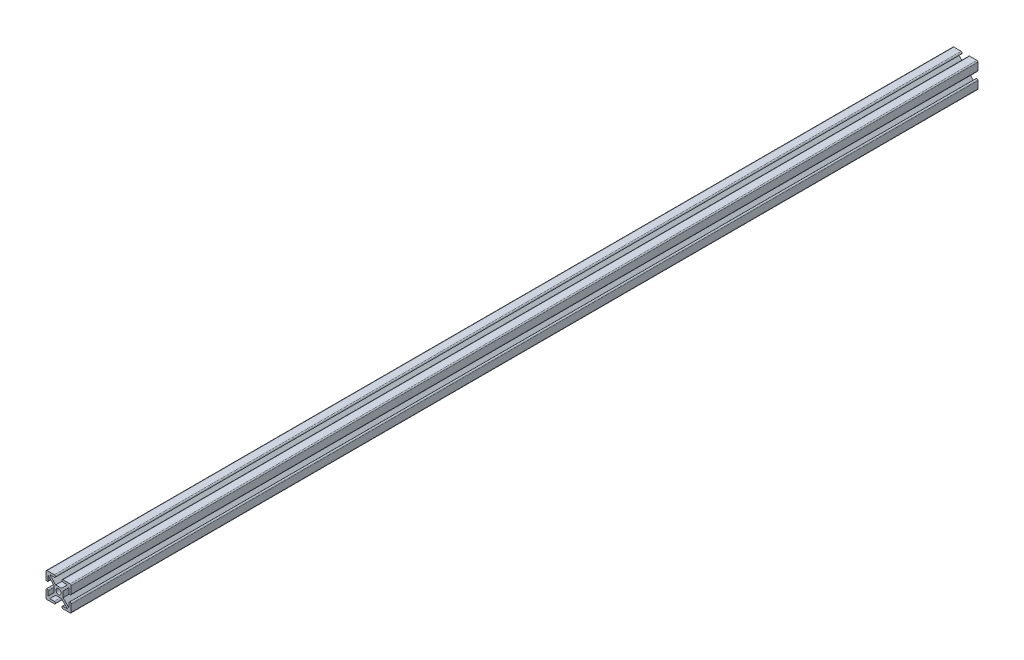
ISO-10303-21;
HEADER;
FILE_DESCRIPTION(('STEP AP214'),'2;1');
FILE_NAME('part.step','',(''),(''),'','','');
FILE_SCHEMA(('AUTOMOTIVE_DESIGN { 1 0 10303 214 1 1 1 1 }'));
ENDSEC;
DATA;
#1=APPLICATION_CONTEXT('core data for automotive mechanical design processes');
#2=APPLICATION_PROTOCOL_DEFINITION('international standard','automotive_design',2000,#1);
#3=PRODUCT_CONTEXT('',#1,'mechanical');
#4=PRODUCT('Part','Part','',(#3));
#5=PRODUCT_RELATED_PRODUCT_CATEGORY('part','',(#4));
#6=PRODUCT_DEFINITION_FORMATION('','',#4);
#7=PRODUCT_DEFINITION_CONTEXT('part definition',#1,'design');
#8=PRODUCT_DEFINITION('design','',#6,#7);
#9=PRODUCT_DEFINITION_SHAPE('','',#8);
#10=(LENGTH_UNIT() NAMED_UNIT(*) SI_UNIT(.MILLI.,.METRE.));
#11=(NAMED_UNIT(*) PLANE_ANGLE_UNIT() SI_UNIT($,.RADIAN.));
#12=(NAMED_UNIT(*) SI_UNIT($,.STERADIAN.) SOLID_ANGLE_UNIT());
#13=UNCERTAINTY_MEASURE_WITH_UNIT(LENGTH_MEASURE(1.E-05),#10,'distance_accuracy_value','');
#14=(GEOMETRIC_REPRESENTATION_CONTEXT(3) GLOBAL_UNCERTAINTY_ASSIGNED_CONTEXT((#13)) GLOBAL_UNIT_ASSIGNED_CONTEXT((#10,
#11,#12)) REPRESENTATION_CONTEXT('',''));
#15=CARTESIAN_POINT('',(0.,0.,0.));
#16=DIRECTION('',(0.,0.,1.));
#17=DIRECTION('',(1.,0.,0.));
#18=AXIS2_PLACEMENT_3D('',#15,#16,#17);
#19=CARTESIAN_POINT('',(-4.5085,0.,-457.2));
#20=DIRECTION('',(1.,0.,0.));
#21=DIRECTION('',(0.,0.,-1.));
#22=AXIS2_PLACEMENT_3D('',#19,#20,#21);
#23=PLANE('',#22);
#24=DIRECTION('',(0.,1.,0.));
#25=VECTOR('',#24,1.);
#26=CARTESIAN_POINT('',(-4.5085,0.,457.2));
#27=LINE('',#26,#25);
#28=CARTESIAN_POINT('',(-4.5085,-2.94593543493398,457.2));
#29=VERTEX_POINT('',#28);
#30=CARTESIAN_POINT('',(-4.5085,2.94593543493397,457.2));
#31=VERTEX_POINT('',#30);
#32=EDGE_CURVE('E327',#29,#31,#27,.T.);
#33=ORIENTED_EDGE('',*,*,#32,.T.);
#34=DIRECTION('',(0.,0.,1.));
#35=VECTOR('',#34,1.);
#36=CARTESIAN_POINT('',(-4.5085,2.94593543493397,-457.2));
#37=LINE('',#36,#35);
#38=CARTESIAN_POINT('',(-4.5085,2.94593543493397,-457.2));
#39=VERTEX_POINT('',#38);
#40=EDGE_CURVE('E11',#39,#31,#37,.T.);
#41=ORIENTED_EDGE('',*,*,#40,.F.);
#42=DIRECTION('',(0.,1.,0.));
#43=VECTOR('',#42,1.);
#44=CARTESIAN_POINT('',(-4.5085,0.,-457.2));
#45=LINE('',#44,#43);
#46=CARTESIAN_POINT('',(-4.5085,-2.94593543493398,-457.2));
#47=VERTEX_POINT('',#46);
#48=EDGE_CURVE('E52',#47,#39,#45,.T.);
#49=ORIENTED_EDGE('',*,*,#48,.F.);
#50=DIRECTION('',(0.,0.,1.));
#51=VECTOR('',#50,1.);
#52=CARTESIAN_POINT('',(-4.5085,-2.94593543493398,-457.2));
#53=LINE('',#52,#51);
#54=EDGE_CURVE('E37',#47,#29,#53,.T.);
#55=ORIENTED_EDGE('',*,*,#54,.T.);
#56=EDGE_LOOP('',(#33,#41,#49,#55));
#57=FACE_BOUND('',#56,.T.);
#58=ADVANCED_FACE('F34',(#57),#23,.F.);
#59=CARTESIAN_POINT('',(-0.781282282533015,-0.781282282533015,-457.2));
#60=DIRECTION('',(-0.707106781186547,-0.707106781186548,0.));
#61=DIRECTION('',(0.707106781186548,-0.707106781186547,0.));
#62=AXIS2_PLACEMENT_3D('',#59,#60,#61);
#63=PLANE('',#62);
#64=DIRECTION('',(0.707106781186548,-0.707106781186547,0.));
#65=VECTOR('',#64,1.);
#66=CARTESIAN_POINT('',(-0.781282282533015,-0.781282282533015,457.2));
#67=LINE('',#66,#65);
#68=CARTESIAN_POINT('',(-10.4902,8.92763543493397,457.2));
#69=VERTEX_POINT('',#68);
#70=EDGE_CURVE('E440',#69,#31,#67,.T.);
#71=ORIENTED_EDGE('',*,*,#70,.F.);
#72=DIRECTION('',(0.,0.,1.));
#73=VECTOR('',#72,1.);
#74=CARTESIAN_POINT('',(-10.4902,8.92763543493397,-457.2));
#75=LINE('',#74,#73);
#76=CARTESIAN_POINT('',(-10.4902,8.92763543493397,-457.2));
#77=VERTEX_POINT('',#76);
#78=EDGE_CURVE('E43',#77,#69,#75,.T.);
#79=ORIENTED_EDGE('',*,*,#78,.F.);
#80=DIRECTION('',(0.707106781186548,-0.707106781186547,0.));
#81=VECTOR('',#80,1.);
#82=CARTESIAN_POINT('',(-0.781282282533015,-0.781282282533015,-457.2));
#83=LINE('',#82,#81);
#84=EDGE_CURVE('E314',#77,#39,#83,.T.);
#85=ORIENTED_EDGE('',*,*,#84,.T.);
#86=ORIENTED_EDGE('',*,*,#40,.T.);
#87=EDGE_LOOP('',(#71,#79,#85,#86));
#88=FACE_BOUND('',#87,.T.);
#89=ADVANCED_FACE('F536',(#88),#63,.T.);
#90=CARTESIAN_POINT('',(-10.4902,0.,-457.2));
#91=DIRECTION('',(1.,0.,0.));
#92=DIRECTION('',(0.,1.,0.));
#93=AXIS2_PLACEMENT_3D('',#90,#91,#92);
#94=PLANE('',#93);
#95=DIRECTION('',(0.,1.,0.));
#96=VECTOR('',#95,1.);
#97=CARTESIAN_POINT('',(-10.4902,0.,457.2));
#98=LINE('',#97,#96);
#99=CARTESIAN_POINT('',(-10.4902,4.3434,457.2));
#100=VERTEX_POINT('',#99);
#101=EDGE_CURVE('E301',#100,#69,#98,.T.);
#102=ORIENTED_EDGE('',*,*,#101,.F.);
#103=DIRECTION('',(0.,0.,1.));
#104=VECTOR('',#103,1.);
#105=CARTESIAN_POINT('',(-10.4902,4.3434,-457.2));
#106=LINE('',#105,#104);
#107=CARTESIAN_POINT('',(-10.4902,4.3434,-457.2));
#108=VERTEX_POINT('',#107);
#109=EDGE_CURVE('E297',#108,#100,#106,.T.);
#110=ORIENTED_EDGE('',*,*,#109,.F.);
#111=DIRECTION('',(0.,1.,0.));
#112=VECTOR('',#111,1.);
#113=CARTESIAN_POINT('',(-10.4902,0.,-457.2));
#114=LINE('',#113,#112);
#115=EDGE_CURVE('E300',#108,#77,#114,.T.);
#116=ORIENTED_EDGE('',*,*,#115,.T.);
#117=ORIENTED_EDGE('',*,*,#78,.T.);
#118=EDGE_LOOP('',(#102,#110,#116,#117));
#119=FACE_BOUND('',#118,.T.);
#120=ADVANCED_FACE('F299',(#119),#94,.T.);
#121=CARTESIAN_POINT('',(-11.5951,4.34339999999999,-457.2));
#122=DIRECTION('',(0.,0.,1.));
#123=DIRECTION('',(1.,0.,0.));
#124=AXIS2_PLACEMENT_3D('',#121,#122,#123);
#125=CYLINDRICAL_SURFACE('',#124,1.1049);
#126=CARTESIAN_POINT('',(-11.5951,4.34339999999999,457.2));
#127=DIRECTION('',(0.,0.,1.));
#128=DIRECTION('',(1.,0.,0.));
#129=AXIS2_PLACEMENT_3D('',#126,#127,#128);
#130=CIRCLE('',#129,1.1049);
#131=CARTESIAN_POINT('',(-12.7,4.3434,457.2));
#132=VERTEX_POINT('',#131);
#133=EDGE_CURVE('E437',#132,#100,#130,.T.);
#134=ORIENTED_EDGE('',*,*,#133,.F.);
#135=DIRECTION('',(0.,0.,1.));
#136=VECTOR('',#135,1.);
#137=CARTESIAN_POINT('',(-12.7,4.3434,-457.2));
#138=LINE('',#137,#136);
#139=CARTESIAN_POINT('',(-12.7,4.3434,-457.2));
#140=VERTEX_POINT('',#139);
#141=EDGE_CURVE('E306',#140,#132,#138,.T.);
#142=ORIENTED_EDGE('',*,*,#141,.F.);
#143=CARTESIAN_POINT('',(-11.5951,4.34339999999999,-457.2));
#144=DIRECTION('',(0.,0.,1.));
#145=DIRECTION('',(1.,0.,0.));
#146=AXIS2_PLACEMENT_3D('',#143,#144,#145);
#147=CIRCLE('',#146,1.1049);
#148=EDGE_CURVE('E312',#140,#108,#147,.T.);
#149=ORIENTED_EDGE('',*,*,#148,.T.);
#150=ORIENTED_EDGE('',*,*,#109,.T.);
#151=EDGE_LOOP('',(#134,#142,#149,#150));
#152=FACE_BOUND('',#151,.T.);
#153=ADVANCED_FACE('F316',(#152),#125,.T.);
#154=CARTESIAN_POINT('',(-12.7,0.,-457.2));
#155=DIRECTION('',(-1.,0.,0.));
#156=DIRECTION('',(0.,-1.,0.));
#157=AXIS2_PLACEMENT_3D('',#154,#155,#156);
#158=PLANE('',#157);
#159=DIRECTION('',(0.,-1.,0.));
#160=VECTOR('',#159,1.);
#161=CARTESIAN_POINT('',(-12.7,0.,457.2));
#162=LINE('',#161,#160);
#163=CARTESIAN_POINT('',(-12.7,11.5951,457.2));
#164=VERTEX_POINT('',#163);
#165=EDGE_CURVE('E434',#164,#132,#162,.T.);
#166=ORIENTED_EDGE('',*,*,#165,.F.);
#167=DIRECTION('',(0.,0.,1.));
#168=VECTOR('',#167,1.);
#169=CARTESIAN_POINT('',(-12.7,11.5951,-457.2));
#170=LINE('',#169,#168);
#171=CARTESIAN_POINT('',(-12.7,11.5951,-457.2));
#172=VERTEX_POINT('',#171);
#173=EDGE_CURVE('E448',#172,#164,#170,.T.);
#174=ORIENTED_EDGE('',*,*,#173,.F.);
#175=DIRECTION('',(0.,-1.,0.));
#176=VECTOR('',#175,1.);
#177=CARTESIAN_POINT('',(-12.7,0.,-457.2));
#178=LINE('',#177,#176);
#179=EDGE_CURVE('E317',#172,#140,#178,.T.);
#180=ORIENTED_EDGE('',*,*,#179,.T.);
#181=ORIENTED_EDGE('',*,*,#141,.T.);
#182=EDGE_LOOP('',(#166,#174,#180,#181));
#183=FACE_BOUND('',#182,.T.);
#184=ADVANCED_FACE('F549',(#183),#158,.T.);
#185=CARTESIAN_POINT('',(-11.5951,11.5951,-457.2));
#186=DIRECTION('',(0.,0.,1.));
#187=DIRECTION('',(1.,0.,0.));
#188=AXIS2_PLACEMENT_3D('',#185,#186,#187);
#189=CYLINDRICAL_SURFACE('',#188,1.1049);
#190=CARTESIAN_POINT('',(-11.5951,11.5951,457.2));
#191=DIRECTION('',(0.,0.,1.));
#192=DIRECTION('',(1.,0.,0.));
#193=AXIS2_PLACEMENT_3D('',#190,#191,#192);
#194=CIRCLE('',#193,1.1049);
#195=CARTESIAN_POINT('',(-11.5951,12.7,457.2));
#196=VERTEX_POINT('',#195);
#197=EDGE_CURVE('E431',#196,#164,#194,.T.);
#198=ORIENTED_EDGE('',*,*,#197,.F.);
#199=DIRECTION('',(0.,0.,1.));
#200=VECTOR('',#199,1.);
#201=CARTESIAN_POINT('',(-11.5951,12.7,-457.2));
#202=LINE('',#201,#200);
#203=CARTESIAN_POINT('',(-11.5951,12.7,-457.2));
#204=VERTEX_POINT('',#203);
#205=EDGE_CURVE('E450',#204,#196,#202,.T.);
#206=ORIENTED_EDGE('',*,*,#205,.F.);
#207=CARTESIAN_POINT('',(-11.5951,11.5951,-457.2));
#208=DIRECTION('',(0.,0.,1.));
#209=DIRECTION('',(1.,0.,0.));
#210=AXIS2_PLACEMENT_3D('',#207,#208,#209);
#211=CIRCLE('',#210,1.1049);
#212=EDGE_CURVE('E319',#204,#172,#211,.T.);
#213=ORIENTED_EDGE('',*,*,#212,.T.);
#214=ORIENTED_EDGE('',*,*,#173,.T.);
#215=EDGE_LOOP('',(#198,#206,#213,#214));
#216=FACE_BOUND('',#215,.T.);
#217=ADVANCED_FACE('F552',(#216),#189,.T.);
#218=CARTESIAN_POINT('',(0.,12.7,-457.2));
#219=DIRECTION('',(0.,1.,0.));
#220=DIRECTION('',(-1.,0.,0.));
#221=AXIS2_PLACEMENT_3D('',#218,#219,#220);
#222=PLANE('',#221);
#223=DIRECTION('',(-1.,0.,0.));
#224=VECTOR('',#223,1.);
#225=CARTESIAN_POINT('',(0.,12.7,457.2));
#226=LINE('',#225,#224);
#227=CARTESIAN_POINT('',(-4.3434,12.7,457.2));
#228=VERTEX_POINT('',#227);
#229=EDGE_CURVE('E428',#228,#196,#226,.T.);
#230=ORIENTED_EDGE('',*,*,#229,.F.);
#231=DIRECTION('',(0.,0.,1.));
#232=VECTOR('',#231,1.);
#233=CARTESIAN_POINT('',(-4.3434,12.7,-457.2));
#234=LINE('',#233,#232);
#235=CARTESIAN_POINT('',(-4.3434,12.7,-457.2));
#236=VERTEX_POINT('',#235);
#237=EDGE_CURVE('E452',#236,#228,#234,.T.);
#238=ORIENTED_EDGE('',*,*,#237,.F.);
#239=DIRECTION('',(-1.,0.,0.));
#240=VECTOR('',#239,1.);
#241=CARTESIAN_POINT('',(0.,12.7,-457.2));
#242=LINE('',#241,#240);
#243=EDGE_CURVE('E785',#236,#204,#242,.T.);
#244=ORIENTED_EDGE('',*,*,#243,.T.);
#245=ORIENTED_EDGE('',*,*,#205,.T.);
#246=EDGE_LOOP('',(#230,#238,#244,#245));
#247=FACE_BOUND('',#246,.T.);
#248=ADVANCED_FACE('F556',(#247),#222,.T.);
#249=CARTESIAN_POINT('',(-4.3434,11.5951,-457.2));
#250=DIRECTION('',(0.,0.,1.));
#251=DIRECTION('',(1.,0.,0.));
#252=AXIS2_PLACEMENT_3D('',#249,#250,#251);
#253=CYLINDRICAL_SURFACE('',#252,1.1049);
#254=CARTESIAN_POINT('',(-4.3434,11.5951,457.2));
#255=DIRECTION('',(0.,0.,1.));
#256=DIRECTION('',(1.,0.,0.));
#257=AXIS2_PLACEMENT_3D('',#254,#255,#256);
#258=CIRCLE('',#257,1.1049);
#259=CARTESIAN_POINT('',(-4.3434,10.4902,457.2));
#260=VERTEX_POINT('',#259);
#261=EDGE_CURVE('E425',#228,#260,#258,.F.);
#262=ORIENTED_EDGE('',*,*,#261,.T.);
#263=DIRECTION('',(0.,0.,1.));
#264=VECTOR('',#263,1.);
#265=CARTESIAN_POINT('',(-4.3434,10.4902,-457.2));
#266=LINE('',#265,#264);
#267=CARTESIAN_POINT('',(-4.3434,10.4902,-457.2));
#268=VERTEX_POINT('',#267);
#269=EDGE_CURVE('E454',#268,#260,#266,.T.);
#270=ORIENTED_EDGE('',*,*,#269,.F.);
#271=CARTESIAN_POINT('',(-4.3434,11.5951,-457.2));
#272=DIRECTION('',(0.,0.,1.));
#273=DIRECTION('',(1.,0.,0.));
#274=AXIS2_PLACEMENT_3D('',#271,#272,#273);
#275=CIRCLE('',#274,1.1049);
#276=EDGE_CURVE('E783',#236,#268,#275,.F.);
#277=ORIENTED_EDGE('',*,*,#276,.F.);
#278=ORIENTED_EDGE('',*,*,#237,.T.);
#279=EDGE_LOOP('',(#262,#270,#277,#278));
#280=FACE_BOUND('',#279,.T.);
#281=ADVANCED_FACE('F560',(#280),#253,.T.);
#282=CARTESIAN_POINT('',(0.,10.4902,-457.2));
#283=DIRECTION('',(0.,-1.,0.));
#284=DIRECTION('',(1.,0.,0.));
#285=AXIS2_PLACEMENT_3D('',#282,#283,#284);
#286=PLANE('',#285);
#287=DIRECTION('',(1.,0.,0.));
#288=VECTOR('',#287,1.);
#289=CARTESIAN_POINT('',(0.,10.4902,457.2));
#290=LINE('',#289,#288);
#291=CARTESIAN_POINT('',(-8.92763543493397,10.4902,457.2));
#292=VERTEX_POINT('',#291);
#293=EDGE_CURVE('E422',#292,#260,#290,.T.);
#294=ORIENTED_EDGE('',*,*,#293,.F.);
#295=DIRECTION('',(0.,0.,1.));
#296=VECTOR('',#295,1.);
#297=CARTESIAN_POINT('',(-8.92763543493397,10.4902,-457.2));
#298=LINE('',#297,#296);
#299=CARTESIAN_POINT('',(-8.92763543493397,10.4902,-457.2));
#300=VERTEX_POINT('',#299);
#301=EDGE_CURVE('E456',#300,#292,#298,.T.);
#302=ORIENTED_EDGE('',*,*,#301,.F.);
#303=DIRECTION('',(1.,0.,0.));
#304=VECTOR('',#303,1.);
#305=CARTESIAN_POINT('',(0.,10.4902,-457.2));
#306=LINE('',#305,#304);
#307=EDGE_CURVE('E780',#300,#268,#306,.T.);
#308=ORIENTED_EDGE('',*,*,#307,.T.);
#309=ORIENTED_EDGE('',*,*,#269,.T.);
#310=EDGE_LOOP('',(#294,#302,#308,#309));
#311=FACE_BOUND('',#310,.T.);
#312=ADVANCED_FACE('F564',(#311),#286,.T.);
#313=CARTESIAN_POINT('',(0.781282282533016,0.781282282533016,-457.2));
#314=DIRECTION('',(0.707106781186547,0.707106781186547,0.));
#315=DIRECTION('',(-0.707106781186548,0.707106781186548,0.));
#316=AXIS2_PLACEMENT_3D('',#313,#314,#315);
#317=PLANE('',#316);
#318=DIRECTION('',(-0.707106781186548,0.707106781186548,0.));
#319=VECTOR('',#318,1.);
#320=CARTESIAN_POINT('',(0.781282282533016,0.781282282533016,457.2));
#321=LINE('',#320,#319);
#322=CARTESIAN_POINT('',(-2.94593543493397,4.5085,457.2));
#323=VERTEX_POINT('',#322);
#324=EDGE_CURVE('E419',#323,#292,#321,.T.);
#325=ORIENTED_EDGE('',*,*,#324,.F.);
#326=DIRECTION('',(0.,0.,1.));
#327=VECTOR('',#326,1.);
#328=CARTESIAN_POINT('',(-2.94593543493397,4.5085,-457.2));
#329=LINE('',#328,#327);
#330=CARTESIAN_POINT('',(-2.94593543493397,4.5085,-457.2));
#331=VERTEX_POINT('',#330);
#332=EDGE_CURVE('E458',#331,#323,#329,.T.);
#333=ORIENTED_EDGE('',*,*,#332,.F.);
#334=DIRECTION('',(-0.707106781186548,0.707106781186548,0.));
#335=VECTOR('',#334,1.);
#336=CARTESIAN_POINT('',(0.781282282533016,0.781282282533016,-457.2));
#337=LINE('',#336,#335);
#338=EDGE_CURVE('E777',#331,#300,#337,.T.);
#339=ORIENTED_EDGE('',*,*,#338,.T.);
#340=ORIENTED_EDGE('',*,*,#301,.T.);
#341=EDGE_LOOP('',(#325,#333,#339,#340));
#342=FACE_BOUND('',#341,.T.);
#343=ADVANCED_FACE('F568',(#342),#317,.T.);
#344=CARTESIAN_POINT('',(0.,4.5085,-457.2));
#345=DIRECTION('',(0.,1.,0.));
#346=DIRECTION('',(0.,0.,1.));
#347=AXIS2_PLACEMENT_3D('',#344,#345,#346);
#348=PLANE('',#347);
#349=DIRECTION('',(-1.,0.,0.));
#350=VECTOR('',#349,1.);
#351=CARTESIAN_POINT('',(0.,4.5085,457.2));
#352=LINE('',#351,#350);
#353=CARTESIAN_POINT('',(2.94593543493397,4.5085,457.2));
#354=VERTEX_POINT('',#353);
#355=EDGE_CURVE('E416',#354,#323,#352,.T.);
#356=ORIENTED_EDGE('',*,*,#355,.F.);
#357=DIRECTION('',(0.,0.,1.));
#358=VECTOR('',#357,1.);
#359=CARTESIAN_POINT('',(2.94593543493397,4.5085,-457.2));
#360=LINE('',#359,#358);
#361=CARTESIAN_POINT('',(2.94593543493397,4.5085,-457.2));
#362=VERTEX_POINT('',#361);
#363=EDGE_CURVE('E460',#362,#354,#360,.T.);
#364=ORIENTED_EDGE('',*,*,#363,.F.);
#365=DIRECTION('',(-1.,0.,0.));
#366=VECTOR('',#365,1.);
#367=CARTESIAN_POINT('',(0.,4.5085,-457.2));
#368=LINE('',#367,#366);
#369=EDGE_CURVE('E774',#362,#331,#368,.T.);
#370=ORIENTED_EDGE('',*,*,#369,.T.);
#371=ORIENTED_EDGE('',*,*,#332,.T.);
#372=EDGE_LOOP('',(#356,#364,#370,#371));
#373=FACE_BOUND('',#372,.T.);
#374=ADVANCED_FACE('F572',(#373),#348,.T.);
#375=CARTESIAN_POINT('',(-0.781282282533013,0.781282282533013,-457.2));
#376=DIRECTION('',(-0.707106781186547,0.707106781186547,0.));
#377=DIRECTION('',(-0.707106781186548,-0.707106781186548,0.));
#378=AXIS2_PLACEMENT_3D('',#375,#376,#377);
#379=PLANE('',#378);
#380=DIRECTION('',(-0.707106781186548,-0.707106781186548,0.));
#381=VECTOR('',#380,1.);
#382=CARTESIAN_POINT('',(-0.781282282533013,0.781282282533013,457.2));
#383=LINE('',#382,#381);
#384=CARTESIAN_POINT('',(8.92763543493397,10.4902,457.2));
#385=VERTEX_POINT('',#384);
#386=EDGE_CURVE('E413',#385,#354,#383,.T.);
#387=ORIENTED_EDGE('',*,*,#386,.F.);
#388=DIRECTION('',(0.,0.,1.));
#389=VECTOR('',#388,1.);
#390=CARTESIAN_POINT('',(8.92763543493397,10.4902,-457.2));
#391=LINE('',#390,#389);
#392=CARTESIAN_POINT('',(8.92763543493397,10.4902,-457.2));
#393=VERTEX_POINT('',#392);
#394=EDGE_CURVE('E462',#393,#385,#391,.T.);
#395=ORIENTED_EDGE('',*,*,#394,.F.);
#396=DIRECTION('',(-0.707106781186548,-0.707106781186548,0.));
#397=VECTOR('',#396,1.);
#398=CARTESIAN_POINT('',(-0.781282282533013,0.781282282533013,-457.2));
#399=LINE('',#398,#397);
#400=EDGE_CURVE('E771',#393,#362,#399,.T.);
#401=ORIENTED_EDGE('',*,*,#400,.T.);
#402=ORIENTED_EDGE('',*,*,#363,.T.);
#403=EDGE_LOOP('',(#387,#395,#401,#402));
#404=FACE_BOUND('',#403,.T.);
#405=ADVANCED_FACE('F576',(#404),#379,.T.);
#406=CARTESIAN_POINT('',(0.,10.4902,-457.2));
#407=DIRECTION('',(0.,-1.,0.));
#408=DIRECTION('',(1.,0.,0.));
#409=AXIS2_PLACEMENT_3D('',#406,#407,#408);
#410=PLANE('',#409);
#411=DIRECTION('',(1.,0.,0.));
#412=VECTOR('',#411,1.);
#413=CARTESIAN_POINT('',(0.,10.4902,457.2));
#414=LINE('',#413,#412);
#415=CARTESIAN_POINT('',(4.3434,10.4902,457.2));
#416=VERTEX_POINT('',#415);
#417=EDGE_CURVE('E410',#416,#385,#414,.T.);
#418=ORIENTED_EDGE('',*,*,#417,.F.);
#419=DIRECTION('',(0.,0.,1.));
#420=VECTOR('',#419,1.);
#421=CARTESIAN_POINT('',(4.3434,10.4902,-457.2));
#422=LINE('',#421,#420);
#423=CARTESIAN_POINT('',(4.3434,10.4902,-457.2));
#424=VERTEX_POINT('',#423);
#425=EDGE_CURVE('E464',#424,#416,#422,.T.);
#426=ORIENTED_EDGE('',*,*,#425,.F.);
#427=DIRECTION('',(1.,0.,0.));
#428=VECTOR('',#427,1.);
#429=CARTESIAN_POINT('',(0.,10.4902,-457.2));
#430=LINE('',#429,#428);
#431=EDGE_CURVE('E768',#424,#393,#430,.T.);
#432=ORIENTED_EDGE('',*,*,#431,.T.);
#433=ORIENTED_EDGE('',*,*,#394,.T.);
#434=EDGE_LOOP('',(#418,#426,#432,#433));
#435=FACE_BOUND('',#434,.T.);
#436=ADVANCED_FACE('F580',(#435),#410,.T.);
#437=CARTESIAN_POINT('',(4.3434,11.5951,-457.2));
#438=DIRECTION('',(0.,0.,1.));
#439=DIRECTION('',(1.,0.,0.));
#440=AXIS2_PLACEMENT_3D('',#437,#438,#439);
#441=CYLINDRICAL_SURFACE('',#440,1.1049);
#442=CARTESIAN_POINT('',(4.3434,11.5951,457.2));
#443=DIRECTION('',(0.,0.,1.));
#444=DIRECTION('',(1.,0.,0.));
#445=AXIS2_PLACEMENT_3D('',#442,#443,#444);
#446=CIRCLE('',#445,1.1049);
#447=CARTESIAN_POINT('',(4.3434,12.7,457.2));
#448=VERTEX_POINT('',#447);
#449=EDGE_CURVE('E407',#448,#416,#446,.T.);
#450=ORIENTED_EDGE('',*,*,#449,.F.);
#451=DIRECTION('',(0.,0.,1.));
#452=VECTOR('',#451,1.);
#453=CARTESIAN_POINT('',(4.3434,12.7,-457.2));
#454=LINE('',#453,#452);
#455=CARTESIAN_POINT('',(4.3434,12.7,-457.2));
#456=VERTEX_POINT('',#455);
#457=EDGE_CURVE('E466',#456,#448,#454,.T.);
#458=ORIENTED_EDGE('',*,*,#457,.F.);
#459=CARTESIAN_POINT('',(4.3434,11.5951,-457.2));
#460=DIRECTION('',(0.,0.,1.));
#461=DIRECTION('',(1.,0.,0.));
#462=AXIS2_PLACEMENT_3D('',#459,#460,#461);
#463=CIRCLE('',#462,1.1049);
#464=EDGE_CURVE('E765',#456,#424,#463,.T.);
#465=ORIENTED_EDGE('',*,*,#464,.T.);
#466=ORIENTED_EDGE('',*,*,#425,.T.);
#467=EDGE_LOOP('',(#450,#458,#465,#466));
#468=FACE_BOUND('',#467,.T.);
#469=ADVANCED_FACE('F584',(#468),#441,.T.);
#470=CARTESIAN_POINT('',(0.,12.7,-457.2));
#471=DIRECTION('',(0.,1.,0.));
#472=DIRECTION('',(-1.,0.,0.));
#473=AXIS2_PLACEMENT_3D('',#470,#471,#472);
#474=PLANE('',#473);
#475=DIRECTION('',(-1.,0.,0.));
#476=VECTOR('',#475,1.);
#477=CARTESIAN_POINT('',(0.,12.7,457.2));
#478=LINE('',#477,#476);
#479=CARTESIAN_POINT('',(11.5951,12.7,457.2));
#480=VERTEX_POINT('',#479);
#481=EDGE_CURVE('E404',#480,#448,#478,.T.);
#482=ORIENTED_EDGE('',*,*,#481,.F.);
#483=DIRECTION('',(0.,0.,1.));
#484=VECTOR('',#483,1.);
#485=CARTESIAN_POINT('',(11.5951,12.7,-457.2));
#486=LINE('',#485,#484);
#487=CARTESIAN_POINT('',(11.5951,12.7,-457.2));
#488=VERTEX_POINT('',#487);
#489=EDGE_CURVE('E468',#488,#480,#486,.T.);
#490=ORIENTED_EDGE('',*,*,#489,.F.);
#491=DIRECTION('',(-1.,0.,0.));
#492=VECTOR('',#491,1.);
#493=CARTESIAN_POINT('',(0.,12.7,-457.2));
#494=LINE('',#493,#492);
#495=EDGE_CURVE('E762',#488,#456,#494,.T.);
#496=ORIENTED_EDGE('',*,*,#495,.T.);
#497=ORIENTED_EDGE('',*,*,#457,.T.);
#498=EDGE_LOOP('',(#482,#490,#496,#497));
#499=FACE_BOUND('',#498,.T.);
#500=ADVANCED_FACE('F588',(#499),#474,.T.);
#501=CARTESIAN_POINT('',(11.5951,11.5951,-457.2));
#502=DIRECTION('',(0.,0.,1.));
#503=DIRECTION('',(1.,0.,0.));
#504=AXIS2_PLACEMENT_3D('',#501,#502,#503);
#505=CYLINDRICAL_SURFACE('',#504,1.1049);
#506=CARTESIAN_POINT('',(11.5951,11.5951,457.2));
#507=DIRECTION('',(0.,0.,1.));
#508=DIRECTION('',(1.,0.,0.));
#509=AXIS2_PLACEMENT_3D('',#506,#507,#508);
#510=CIRCLE('',#509,1.1049);
#511=CARTESIAN_POINT('',(12.7,11.5951,457.2));
#512=VERTEX_POINT('',#511);
#513=EDGE_CURVE('E401',#512,#480,#510,.T.);
#514=ORIENTED_EDGE('',*,*,#513,.F.);
#515=DIRECTION('',(0.,0.,1.));
#516=VECTOR('',#515,1.);
#517=CARTESIAN_POINT('',(12.7,11.5951,-457.2));
#518=LINE('',#517,#516);
#519=CARTESIAN_POINT('',(12.7,11.5951,-457.2));
#520=VERTEX_POINT('',#519);
#521=EDGE_CURVE('E470',#520,#512,#518,.T.);
#522=ORIENTED_EDGE('',*,*,#521,.F.);
#523=CARTESIAN_POINT('',(11.5951,11.5951,-457.2));
#524=DIRECTION('',(0.,0.,1.));
#525=DIRECTION('',(1.,0.,0.));
#526=AXIS2_PLACEMENT_3D('',#523,#524,#525);
#527=CIRCLE('',#526,1.1049);
#528=EDGE_CURVE('E759',#520,#488,#527,.T.);
#529=ORIENTED_EDGE('',*,*,#528,.T.);
#530=ORIENTED_EDGE('',*,*,#489,.T.);
#531=EDGE_LOOP('',(#514,#522,#529,#530));
#532=FACE_BOUND('',#531,.T.);
#533=ADVANCED_FACE('F592',(#532),#505,.T.);
#534=CARTESIAN_POINT('',(12.7,0.,-457.2));
#535=DIRECTION('',(1.,0.,0.));
#536=DIRECTION('',(0.,0.,-1.));
#537=AXIS2_PLACEMENT_3D('',#534,#535,#536);
#538=PLANE('',#537);
#539=DIRECTION('',(0.,1.,0.));
#540=VECTOR('',#539,1.);
#541=CARTESIAN_POINT('',(12.7,0.,457.2));
#542=LINE('',#541,#540);
#543=CARTESIAN_POINT('',(12.7,4.3434,457.2));
#544=VERTEX_POINT('',#543);
#545=EDGE_CURVE('E398',#544,#512,#542,.T.);
#546=ORIENTED_EDGE('',*,*,#545,.F.);
#547=DIRECTION('',(0.,0.,1.));
#548=VECTOR('',#547,1.);
#549=CARTESIAN_POINT('',(12.7,4.3434,-457.2));
#550=LINE('',#549,#548);
#551=CARTESIAN_POINT('',(12.7,4.3434,-457.2));
#552=VERTEX_POINT('',#551);
#553=EDGE_CURVE('E472',#552,#544,#550,.T.);
#554=ORIENTED_EDGE('',*,*,#553,.F.);
#555=DIRECTION('',(0.,1.,0.));
#556=VECTOR('',#555,1.);
#557=CARTESIAN_POINT('',(12.7,0.,-457.2));
#558=LINE('',#557,#556);
#559=EDGE_CURVE('E756',#552,#520,#558,.T.);
#560=ORIENTED_EDGE('',*,*,#559,.T.);
#561=ORIENTED_EDGE('',*,*,#521,.T.);
#562=EDGE_LOOP('',(#546,#554,#560,#561));
#563=FACE_BOUND('',#562,.T.);
#564=ADVANCED_FACE('F596',(#563),#538,.T.);
#565=CARTESIAN_POINT('',(11.5951,4.3434,-457.2));
#566=DIRECTION('',(0.,0.,1.));
#567=DIRECTION('',(1.,0.,0.));
#568=AXIS2_PLACEMENT_3D('',#565,#566,#567);
#569=CYLINDRICAL_SURFACE('',#568,1.1049);
#570=CARTESIAN_POINT('',(11.5951,4.3434,457.2));
#571=DIRECTION('',(0.,0.,1.));
#572=DIRECTION('',(1.,0.,0.));
#573=AXIS2_PLACEMENT_3D('',#570,#571,#572);
#574=CIRCLE('',#573,1.1049);
#575=CARTESIAN_POINT('',(10.4902,4.3434,457.2));
#576=VERTEX_POINT('',#575);
#577=EDGE_CURVE('E395',#544,#576,#574,.F.);
#578=ORIENTED_EDGE('',*,*,#577,.T.);
#579=DIRECTION('',(0.,0.,1.));
#580=VECTOR('',#579,1.);
#581=CARTESIAN_POINT('',(10.4902,4.3434,-457.2));
#582=LINE('',#581,#580);
#583=CARTESIAN_POINT('',(10.4902,4.3434,-457.2));
#584=VERTEX_POINT('',#583);
#585=EDGE_CURVE('E474',#584,#576,#582,.T.);
#586=ORIENTED_EDGE('',*,*,#585,.F.);
#587=CARTESIAN_POINT('',(11.5951,4.3434,-457.2));
#588=DIRECTION('',(0.,0.,1.));
#589=DIRECTION('',(1.,0.,0.));
#590=AXIS2_PLACEMENT_3D('',#587,#588,#589);
#591=CIRCLE('',#590,1.1049);
#592=EDGE_CURVE('E754',#552,#584,#591,.F.);
#593=ORIENTED_EDGE('',*,*,#592,.F.);
#594=ORIENTED_EDGE('',*,*,#553,.T.);
#595=EDGE_LOOP('',(#578,#586,#593,#594));
#596=FACE_BOUND('',#595,.T.);
#597=ADVANCED_FACE('F600',(#596),#569,.T.);
#598=CARTESIAN_POINT('',(10.4902,0.,-457.2));
#599=DIRECTION('',(-1.,0.,0.));
#600=DIRECTION('',(0.,-1.,0.));
#601=AXIS2_PLACEMENT_3D('',#598,#599,#600);
#602=PLANE('',#601);
#603=DIRECTION('',(0.,-1.,0.));
#604=VECTOR('',#603,1.);
#605=CARTESIAN_POINT('',(10.4902,0.,457.2));
#606=LINE('',#605,#604);
#607=CARTESIAN_POINT('',(10.4902,8.92763543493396,457.2));
#608=VERTEX_POINT('',#607);
#609=EDGE_CURVE('E392',#608,#576,#606,.T.);
#610=ORIENTED_EDGE('',*,*,#609,.F.);
#611=DIRECTION('',(0.,0.,1.));
#612=VECTOR('',#611,1.);
#613=CARTESIAN_POINT('',(10.4902,8.92763543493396,-457.2));
#614=LINE('',#613,#612);
#615=CARTESIAN_POINT('',(10.4902,8.92763543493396,-457.2));
#616=VERTEX_POINT('',#615);
#617=EDGE_CURVE('E476',#616,#608,#614,.T.);
#618=ORIENTED_EDGE('',*,*,#617,.F.);
#619=DIRECTION('',(0.,-1.,0.));
#620=VECTOR('',#619,1.);
#621=CARTESIAN_POINT('',(10.4902,0.,-457.2));
#622=LINE('',#621,#620);
#623=EDGE_CURVE('E751',#616,#584,#622,.T.);
#624=ORIENTED_EDGE('',*,*,#623,.T.);
#625=ORIENTED_EDGE('',*,*,#585,.T.);
#626=EDGE_LOOP('',(#610,#618,#624,#625));
#627=FACE_BOUND('',#626,.T.);
#628=ADVANCED_FACE('F604',(#627),#602,.T.);
#629=CARTESIAN_POINT('',(0.781282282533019,-0.781282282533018,-457.2));
#630=DIRECTION('',(0.707106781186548,-0.707106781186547,0.));
#631=DIRECTION('',(0.707106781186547,0.707106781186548,0.));
#632=AXIS2_PLACEMENT_3D('',#629,#630,#631);
#633=PLANE('',#632);
#634=DIRECTION('',(0.707106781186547,0.707106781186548,0.));
#635=VECTOR('',#634,1.);
#636=CARTESIAN_POINT('',(0.781282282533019,-0.781282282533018,457.2));
#637=LINE('',#636,#635);
#638=CARTESIAN_POINT('',(4.5085,2.94593543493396,457.2));
#639=VERTEX_POINT('',#638);
#640=EDGE_CURVE('E389',#639,#608,#637,.T.);
#641=ORIENTED_EDGE('',*,*,#640,.F.);
#642=DIRECTION('',(0.,0.,1.));
#643=VECTOR('',#642,1.);
#644=CARTESIAN_POINT('',(4.5085,2.94593543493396,-457.2));
#645=LINE('',#644,#643);
#646=CARTESIAN_POINT('',(4.5085,2.94593543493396,-457.2));
#647=VERTEX_POINT('',#646);
#648=EDGE_CURVE('E478',#647,#639,#645,.T.);
#649=ORIENTED_EDGE('',*,*,#648,.F.);
#650=DIRECTION('',(0.707106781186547,0.707106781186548,0.));
#651=VECTOR('',#650,1.);
#652=CARTESIAN_POINT('',(0.781282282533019,-0.781282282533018,-457.2));
#653=LINE('',#652,#651);
#654=EDGE_CURVE('E748',#647,#616,#653,.T.);
#655=ORIENTED_EDGE('',*,*,#654,.T.);
#656=ORIENTED_EDGE('',*,*,#617,.T.);
#657=EDGE_LOOP('',(#641,#649,#655,#656));
#658=FACE_BOUND('',#657,.T.);
#659=ADVANCED_FACE('F608',(#658),#633,.T.);
#660=CARTESIAN_POINT('',(4.5085,0.,-457.2));
#661=DIRECTION('',(1.,0.,0.));
#662=DIRECTION('',(0.,0.,-1.));
#663=AXIS2_PLACEMENT_3D('',#660,#661,#662);
#664=PLANE('',#663);
#665=DIRECTION('',(0.,1.,0.));
#666=VECTOR('',#665,1.);
#667=CARTESIAN_POINT('',(4.5085,0.,457.2));
#668=LINE('',#667,#666);
#669=CARTESIAN_POINT('',(4.5085,-2.94593543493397,457.2));
#670=VERTEX_POINT('',#669);
#671=EDGE_CURVE('E386',#670,#639,#668,.T.);
#672=ORIENTED_EDGE('',*,*,#671,.F.);
#673=DIRECTION('',(0.,0.,1.));
#674=VECTOR('',#673,1.);
#675=CARTESIAN_POINT('',(4.5085,-2.94593543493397,-457.2));
#676=LINE('',#675,#674);
#677=CARTESIAN_POINT('',(4.5085,-2.94593543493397,-457.2));
#678=VERTEX_POINT('',#677);
#679=EDGE_CURVE('E480',#678,#670,#676,.T.);
#680=ORIENTED_EDGE('',*,*,#679,.F.);
#681=DIRECTION('',(0.,1.,0.));
#682=VECTOR('',#681,1.);
#683=CARTESIAN_POINT('',(4.5085,0.,-457.2));
#684=LINE('',#683,#682);
#685=EDGE_CURVE('E745',#678,#647,#684,.T.);
#686=ORIENTED_EDGE('',*,*,#685,.T.);
#687=ORIENTED_EDGE('',*,*,#648,.T.);
#688=EDGE_LOOP('',(#672,#680,#686,#687));
#689=FACE_BOUND('',#688,.T.);
#690=ADVANCED_FACE('F612',(#689),#664,.T.);
#691=CARTESIAN_POINT('',(0.781282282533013,0.781282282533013,-457.2));
#692=DIRECTION('',(0.707106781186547,0.707106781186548,0.));
#693=DIRECTION('',(-0.707106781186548,0.707106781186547,0.));
#694=AXIS2_PLACEMENT_3D('',#691,#692,#693);
#695=PLANE('',#694);
#696=DIRECTION('',(-0.707106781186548,0.707106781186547,0.));
#697=VECTOR('',#696,1.);
#698=CARTESIAN_POINT('',(0.781282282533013,0.781282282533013,457.2));
#699=LINE('',#698,#697);
#700=CARTESIAN_POINT('',(10.4902,-8.92763543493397,457.2));
#701=VERTEX_POINT('',#700);
#702=EDGE_CURVE('E383',#701,#670,#699,.T.);
#703=ORIENTED_EDGE('',*,*,#702,.F.);
#704=DIRECTION('',(0.,0.,1.));
#705=VECTOR('',#704,1.);
#706=CARTESIAN_POINT('',(10.4902,-8.92763543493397,-457.2));
#707=LINE('',#706,#705);
#708=CARTESIAN_POINT('',(10.4902,-8.92763543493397,-457.2));
#709=VERTEX_POINT('',#708);
#710=EDGE_CURVE('E482',#709,#701,#707,.T.);
#711=ORIENTED_EDGE('',*,*,#710,.F.);
#712=DIRECTION('',(-0.707106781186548,0.707106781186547,0.));
#713=VECTOR('',#712,1.);
#714=CARTESIAN_POINT('',(0.781282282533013,0.781282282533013,-457.2));
#715=LINE('',#714,#713);
#716=EDGE_CURVE('E742',#709,#678,#715,.T.);
#717=ORIENTED_EDGE('',*,*,#716,.T.);
#718=ORIENTED_EDGE('',*,*,#679,.T.);
#719=EDGE_LOOP('',(#703,#711,#717,#718));
#720=FACE_BOUND('',#719,.T.);
#721=ADVANCED_FACE('F616',(#720),#695,.T.);
#722=CARTESIAN_POINT('',(10.4902,0.,-457.2));
#723=DIRECTION('',(-1.,0.,0.));
#724=DIRECTION('',(0.,0.,1.));
#725=AXIS2_PLACEMENT_3D('',#722,#723,#724);
#726=PLANE('',#725);
#727=DIRECTION('',(0.,-1.,0.));
#728=VECTOR('',#727,1.);
#729=CARTESIAN_POINT('',(10.4902,0.,457.2));
#730=LINE('',#729,#728);
#731=CARTESIAN_POINT('',(10.4902,-4.3434,457.2));
#732=VERTEX_POINT('',#731);
#733=EDGE_CURVE('E380',#732,#701,#730,.T.);
#734=ORIENTED_EDGE('',*,*,#733,.F.);
#735=DIRECTION('',(0.,0.,1.));
#736=VECTOR('',#735,1.);
#737=CARTESIAN_POINT('',(10.4902,-4.3434,-457.2));
#738=LINE('',#737,#736);
#739=CARTESIAN_POINT('',(10.4902,-4.3434,-457.2));
#740=VERTEX_POINT('',#739);
#741=EDGE_CURVE('E484',#740,#732,#738,.T.);
#742=ORIENTED_EDGE('',*,*,#741,.F.);
#743=DIRECTION('',(0.,-1.,0.));
#744=VECTOR('',#743,1.);
#745=CARTESIAN_POINT('',(10.4902,0.,-457.2));
#746=LINE('',#745,#744);
#747=EDGE_CURVE('E739',#740,#709,#746,.T.);
#748=ORIENTED_EDGE('',*,*,#747,.T.);
#749=ORIENTED_EDGE('',*,*,#710,.T.);
#750=EDGE_LOOP('',(#734,#742,#748,#749));
#751=FACE_BOUND('',#750,.T.);
#752=ADVANCED_FACE('F620',(#751),#726,.T.);
#753=CARTESIAN_POINT('',(11.5951,-4.3434,-457.2));
#754=DIRECTION('',(0.,0.,1.));
#755=DIRECTION('',(1.,0.,0.));
#756=AXIS2_PLACEMENT_3D('',#753,#754,#755);
#757=CYLINDRICAL_SURFACE('',#756,1.1049);
#758=CARTESIAN_POINT('',(11.5951,-4.3434,457.2));
#759=DIRECTION('',(0.,0.,1.));
#760=DIRECTION('',(1.,0.,0.));
#761=AXIS2_PLACEMENT_3D('',#758,#759,#760);
#762=CIRCLE('',#761,1.1049);
#763=CARTESIAN_POINT('',(12.7,-4.3434,457.2));
#764=VERTEX_POINT('',#763);
#765=EDGE_CURVE('E377',#764,#732,#762,.T.);
#766=ORIENTED_EDGE('',*,*,#765,.F.);
#767=DIRECTION('',(0.,0.,1.));
#768=VECTOR('',#767,1.);
#769=CARTESIAN_POINT('',(12.7,-4.3434,-457.2));
#770=LINE('',#769,#768);
#771=CARTESIAN_POINT('',(12.7,-4.3434,-457.2));
#772=VERTEX_POINT('',#771);
#773=EDGE_CURVE('E486',#772,#764,#770,.T.);
#774=ORIENTED_EDGE('',*,*,#773,.F.);
#775=CARTESIAN_POINT('',(11.5951,-4.3434,-457.2));
#776=DIRECTION('',(0.,0.,1.));
#777=DIRECTION('',(1.,0.,0.));
#778=AXIS2_PLACEMENT_3D('',#775,#776,#777);
#779=CIRCLE('',#778,1.1049);
#780=EDGE_CURVE('E736',#772,#740,#779,.T.);
#781=ORIENTED_EDGE('',*,*,#780,.T.);
#782=ORIENTED_EDGE('',*,*,#741,.T.);
#783=EDGE_LOOP('',(#766,#774,#781,#782));
#784=FACE_BOUND('',#783,.T.);
#785=ADVANCED_FACE('F624',(#784),#757,.T.);
#786=CARTESIAN_POINT('',(12.7,0.,-457.2));
#787=DIRECTION('',(1.,0.,0.));
#788=DIRECTION('',(0.,1.,0.));
#789=AXIS2_PLACEMENT_3D('',#786,#787,#788);
#790=PLANE('',#789);
#791=DIRECTION('',(0.,1.,0.));
#792=VECTOR('',#791,1.);
#793=CARTESIAN_POINT('',(12.7,0.,457.2));
#794=LINE('',#793,#792);
#795=CARTESIAN_POINT('',(12.7,-11.5951,457.2));
#796=VERTEX_POINT('',#795);
#797=EDGE_CURVE('E374',#796,#764,#794,.T.);
#798=ORIENTED_EDGE('',*,*,#797,.F.);
#799=DIRECTION('',(0.,0.,1.));
#800=VECTOR('',#799,1.);
#801=CARTESIAN_POINT('',(12.7,-11.5951,-457.2));
#802=LINE('',#801,#800);
#803=CARTESIAN_POINT('',(12.7,-11.5951,-457.2));
#804=VERTEX_POINT('',#803);
#805=EDGE_CURVE('E488',#804,#796,#802,.T.);
#806=ORIENTED_EDGE('',*,*,#805,.F.);
#807=DIRECTION('',(0.,1.,0.));
#808=VECTOR('',#807,1.);
#809=CARTESIAN_POINT('',(12.7,0.,-457.2));
#810=LINE('',#809,#808);
#811=EDGE_CURVE('E733',#804,#772,#810,.T.);
#812=ORIENTED_EDGE('',*,*,#811,.T.);
#813=ORIENTED_EDGE('',*,*,#773,.T.);
#814=EDGE_LOOP('',(#798,#806,#812,#813));
#815=FACE_BOUND('',#814,.T.);
#816=ADVANCED_FACE('F628',(#815),#790,.T.);
#817=CARTESIAN_POINT('',(11.5951,-11.5951,-457.2));
#818=DIRECTION('',(0.,0.,1.));
#819=DIRECTION('',(1.,0.,0.));
#820=AXIS2_PLACEMENT_3D('',#817,#818,#819);
#821=CYLINDRICAL_SURFACE('',#820,1.1049);
#822=CARTESIAN_POINT('',(11.5951,-11.5951,457.2));
#823=DIRECTION('',(0.,0.,1.));
#824=DIRECTION('',(1.,0.,0.));
#825=AXIS2_PLACEMENT_3D('',#822,#823,#824);
#826=CIRCLE('',#825,1.1049);
#827=CARTESIAN_POINT('',(11.5951,-12.7,457.2));
#828=VERTEX_POINT('',#827);
#829=EDGE_CURVE('E371',#828,#796,#826,.T.);
#830=ORIENTED_EDGE('',*,*,#829,.F.);
#831=DIRECTION('',(0.,0.,1.));
#832=VECTOR('',#831,1.);
#833=CARTESIAN_POINT('',(11.5951,-12.7,-457.2));
#834=LINE('',#833,#832);
#835=CARTESIAN_POINT('',(11.5951,-12.7,-457.2));
#836=VERTEX_POINT('',#835);
#837=EDGE_CURVE('E490',#836,#828,#834,.T.);
#838=ORIENTED_EDGE('',*,*,#837,.F.);
#839=CARTESIAN_POINT('',(11.5951,-11.5951,-457.2));
#840=DIRECTION('',(0.,0.,1.));
#841=DIRECTION('',(1.,0.,0.));
#842=AXIS2_PLACEMENT_3D('',#839,#840,#841);
#843=CIRCLE('',#842,1.1049);
#844=EDGE_CURVE('E730',#836,#804,#843,.T.);
#845=ORIENTED_EDGE('',*,*,#844,.T.);
#846=ORIENTED_EDGE('',*,*,#805,.T.);
#847=EDGE_LOOP('',(#830,#838,#845,#846));
#848=FACE_BOUND('',#847,.T.);
#849=ADVANCED_FACE('F632',(#848),#821,.T.);
#850=CARTESIAN_POINT('',(0.,-12.7,-457.2));
#851=DIRECTION('',(0.,-1.,0.));
#852=DIRECTION('',(1.,0.,0.));
#853=AXIS2_PLACEMENT_3D('',#850,#851,#852);
#854=PLANE('',#853);
#855=DIRECTION('',(1.,0.,0.));
#856=VECTOR('',#855,1.);
#857=CARTESIAN_POINT('',(0.,-12.7,457.2));
#858=LINE('',#857,#856);
#859=CARTESIAN_POINT('',(4.3434,-12.7,457.2));
#860=VERTEX_POINT('',#859);
#861=EDGE_CURVE('E368',#860,#828,#858,.T.);
#862=ORIENTED_EDGE('',*,*,#861,.F.);
#863=DIRECTION('',(0.,0.,1.));
#864=VECTOR('',#863,1.);
#865=CARTESIAN_POINT('',(4.3434,-12.7,-457.2));
#866=LINE('',#865,#864);
#867=CARTESIAN_POINT('',(4.3434,-12.7,-457.2));
#868=VERTEX_POINT('',#867);
#869=EDGE_CURVE('E492',#868,#860,#866,.T.);
#870=ORIENTED_EDGE('',*,*,#869,.F.);
#871=DIRECTION('',(1.,0.,0.));
#872=VECTOR('',#871,1.);
#873=CARTESIAN_POINT('',(0.,-12.7,-457.2));
#874=LINE('',#873,#872);
#875=EDGE_CURVE('E727',#868,#836,#874,.T.);
#876=ORIENTED_EDGE('',*,*,#875,.T.);
#877=ORIENTED_EDGE('',*,*,#837,.T.);
#878=EDGE_LOOP('',(#862,#870,#876,#877));
#879=FACE_BOUND('',#878,.T.);
#880=ADVANCED_FACE('F636',(#879),#854,.T.);
#881=CARTESIAN_POINT('',(4.3434,-11.5951,-457.2));
#882=DIRECTION('',(0.,0.,1.));
#883=DIRECTION('',(1.,0.,0.));
#884=AXIS2_PLACEMENT_3D('',#881,#882,#883);
#885=CYLINDRICAL_SURFACE('',#884,1.1049);
#886=CARTESIAN_POINT('',(4.3434,-11.5951,457.2));
#887=DIRECTION('',(0.,0.,1.));
#888=DIRECTION('',(1.,0.,0.));
#889=AXIS2_PLACEMENT_3D('',#886,#887,#888);
#890=CIRCLE('',#889,1.1049);
#891=CARTESIAN_POINT('',(4.3434,-10.4902,457.2));
#892=VERTEX_POINT('',#891);
#893=EDGE_CURVE('E365',#860,#892,#890,.F.);
#894=ORIENTED_EDGE('',*,*,#893,.T.);
#895=DIRECTION('',(0.,0.,1.));
#896=VECTOR('',#895,1.);
#897=CARTESIAN_POINT('',(4.3434,-10.4902,-457.2));
#898=LINE('',#897,#896);
#899=CARTESIAN_POINT('',(4.3434,-10.4902,-457.2));
#900=VERTEX_POINT('',#899);
#901=EDGE_CURVE('E494',#900,#892,#898,.T.);
#902=ORIENTED_EDGE('',*,*,#901,.F.);
#903=CARTESIAN_POINT('',(4.3434,-11.5951,-457.2));
#904=DIRECTION('',(0.,0.,1.));
#905=DIRECTION('',(1.,0.,0.));
#906=AXIS2_PLACEMENT_3D('',#903,#904,#905);
#907=CIRCLE('',#906,1.1049);
#908=EDGE_CURVE('E725',#868,#900,#907,.F.);
#909=ORIENTED_EDGE('',*,*,#908,.F.);
#910=ORIENTED_EDGE('',*,*,#869,.T.);
#911=EDGE_LOOP('',(#894,#902,#909,#910));
#912=FACE_BOUND('',#911,.T.);
#913=ADVANCED_FACE('F640',(#912),#885,.T.);
#914=CARTESIAN_POINT('',(0.,-10.4902,-457.2));
#915=DIRECTION('',(0.,1.,0.));
#916=DIRECTION('',(-1.,0.,0.));
#917=AXIS2_PLACEMENT_3D('',#914,#915,#916);
#918=PLANE('',#917);
#919=DIRECTION('',(-1.,0.,0.));
#920=VECTOR('',#919,1.);
#921=CARTESIAN_POINT('',(0.,-10.4902,457.2));
#922=LINE('',#921,#920);
#923=CARTESIAN_POINT('',(8.92763543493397,-10.4902,457.2));
#924=VERTEX_POINT('',#923);
#925=EDGE_CURVE('E362',#924,#892,#922,.T.);
#926=ORIENTED_EDGE('',*,*,#925,.F.);
#927=DIRECTION('',(0.,0.,1.));
#928=VECTOR('',#927,1.);
#929=CARTESIAN_POINT('',(8.92763543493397,-10.4902,-457.2));
#930=LINE('',#929,#928);
#931=CARTESIAN_POINT('',(8.92763543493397,-10.4902,-457.2));
#932=VERTEX_POINT('',#931);
#933=EDGE_CURVE('E496',#932,#924,#930,.T.);
#934=ORIENTED_EDGE('',*,*,#933,.F.);
#935=DIRECTION('',(-1.,0.,0.));
#936=VECTOR('',#935,1.);
#937=CARTESIAN_POINT('',(0.,-10.4902,-457.2));
#938=LINE('',#937,#936);
#939=EDGE_CURVE('E722',#932,#900,#938,.T.);
#940=ORIENTED_EDGE('',*,*,#939,.T.);
#941=ORIENTED_EDGE('',*,*,#901,.T.);
#942=EDGE_LOOP('',(#926,#934,#940,#941));
#943=FACE_BOUND('',#942,.T.);
#944=ADVANCED_FACE('F644',(#943),#918,.T.);
#945=CARTESIAN_POINT('',(-0.781282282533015,-0.781282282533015,-457.2));
#946=DIRECTION('',(-0.707106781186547,-0.707106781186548,0.));
#947=DIRECTION('',(0.707106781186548,-0.707106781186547,0.));
#948=AXIS2_PLACEMENT_3D('',#945,#946,#947);
#949=PLANE('',#948);
#950=DIRECTION('',(0.707106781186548,-0.707106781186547,0.));
#951=VECTOR('',#950,1.);
#952=CARTESIAN_POINT('',(-0.781282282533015,-0.781282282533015,457.2));
#953=LINE('',#952,#951);
#954=CARTESIAN_POINT('',(2.94593543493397,-4.5085,457.2));
#955=VERTEX_POINT('',#954);
#956=EDGE_CURVE('E359',#955,#924,#953,.T.);
#957=ORIENTED_EDGE('',*,*,#956,.F.);
#958=DIRECTION('',(0.,0.,1.));
#959=VECTOR('',#958,1.);
#960=CARTESIAN_POINT('',(2.94593543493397,-4.5085,-457.2));
#961=LINE('',#960,#959);
#962=CARTESIAN_POINT('',(2.94593543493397,-4.5085,-457.2));
#963=VERTEX_POINT('',#962);
#964=EDGE_CURVE('E498',#963,#955,#961,.T.);
#965=ORIENTED_EDGE('',*,*,#964,.F.);
#966=DIRECTION('',(0.707106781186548,-0.707106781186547,0.));
#967=VECTOR('',#966,1.);
#968=CARTESIAN_POINT('',(-0.781282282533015,-0.781282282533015,-457.2));
#969=LINE('',#968,#967);
#970=EDGE_CURVE('E719',#963,#932,#969,.T.);
#971=ORIENTED_EDGE('',*,*,#970,.T.);
#972=ORIENTED_EDGE('',*,*,#933,.T.);
#973=EDGE_LOOP('',(#957,#965,#971,#972));
#974=FACE_BOUND('',#973,.T.);
#975=ADVANCED_FACE('F648',(#974),#949,.T.);
#976=CARTESIAN_POINT('',(0.,-4.5085,-457.2));
#977=DIRECTION('',(0.,1.,0.));
#978=DIRECTION('',(0.,0.,1.));
#979=AXIS2_PLACEMENT_3D('',#976,#977,#978);
#980=PLANE('',#979);
#981=DIRECTION('',(-1.,0.,0.));
#982=VECTOR('',#981,1.);
#983=CARTESIAN_POINT('',(0.,-4.5085,457.2));
#984=LINE('',#983,#982);
#985=CARTESIAN_POINT('',(-2.94593543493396,-4.5085,457.2));
#986=VERTEX_POINT('',#985);
#987=EDGE_CURVE('E356',#955,#986,#984,.T.);
#988=ORIENTED_EDGE('',*,*,#987,.T.);
#989=DIRECTION('',(0.,0.,1.));
#990=VECTOR('',#989,1.);
#991=CARTESIAN_POINT('',(-2.94593543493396,-4.5085,-457.2));
#992=LINE('',#991,#990);
#993=CARTESIAN_POINT('',(-2.94593543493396,-4.5085,-457.2));
#994=VERTEX_POINT('',#993);
#995=EDGE_CURVE('E500',#994,#986,#992,.T.);
#996=ORIENTED_EDGE('',*,*,#995,.F.);
#997=DIRECTION('',(-1.,0.,0.));
#998=VECTOR('',#997,1.);
#999=CARTESIAN_POINT('',(0.,-4.5085,-457.2));
#1000=LINE('',#999,#998);
#1001=EDGE_CURVE('E717',#963,#994,#1000,.T.);
#1002=ORIENTED_EDGE('',*,*,#1001,.F.);
#1003=ORIENTED_EDGE('',*,*,#964,.T.);
#1004=EDGE_LOOP('',(#988,#996,#1002,#1003));
#1005=FACE_BOUND('',#1004,.T.);
#1006=ADVANCED_FACE('F652',(#1005),#980,.F.);
#1007=CARTESIAN_POINT('',(0.781282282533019,-0.781282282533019,-457.2));
#1008=DIRECTION('',(0.707106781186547,-0.707106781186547,0.));
#1009=DIRECTION('',(0.707106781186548,0.707106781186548,0.));
#1010=AXIS2_PLACEMENT_3D('',#1007,#1008,#1009);
#1011=PLANE('',#1010);
#1012=DIRECTION('',(0.707106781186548,0.707106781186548,0.));
#1013=VECTOR('',#1012,1.);
#1014=CARTESIAN_POINT('',(0.781282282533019,-0.781282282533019,457.2));
#1015=LINE('',#1014,#1013);
#1016=CARTESIAN_POINT('',(-8.92763543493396,-10.4902,457.2));
#1017=VERTEX_POINT('',#1016);
#1018=EDGE_CURVE('E353',#1017,#986,#1015,.T.);
#1019=ORIENTED_EDGE('',*,*,#1018,.F.);
#1020=DIRECTION('',(0.,0.,1.));
#1021=VECTOR('',#1020,1.);
#1022=CARTESIAN_POINT('',(-8.92763543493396,-10.4902,-457.2));
#1023=LINE('',#1022,#1021);
#1024=CARTESIAN_POINT('',(-8.92763543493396,-10.4902,-457.2));
#1025=VERTEX_POINT('',#1024);
#1026=EDGE_CURVE('E502',#1025,#1017,#1023,.T.);
#1027=ORIENTED_EDGE('',*,*,#1026,.F.);
#1028=DIRECTION('',(0.707106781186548,0.707106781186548,0.));
#1029=VECTOR('',#1028,1.);
#1030=CARTESIAN_POINT('',(0.781282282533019,-0.781282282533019,-457.2));
#1031=LINE('',#1030,#1029);
#1032=EDGE_CURVE('E714',#1025,#994,#1031,.T.);
#1033=ORIENTED_EDGE('',*,*,#1032,.T.);
#1034=ORIENTED_EDGE('',*,*,#995,.T.);
#1035=EDGE_LOOP('',(#1019,#1027,#1033,#1034));
#1036=FACE_BOUND('',#1035,.T.);
#1037=ADVANCED_FACE('F656',(#1036),#1011,.T.);
#1038=CARTESIAN_POINT('',(0.,-10.4902,-457.2));
#1039=DIRECTION('',(0.,1.,0.));
#1040=DIRECTION('',(-1.,0.,0.));
#1041=AXIS2_PLACEMENT_3D('',#1038,#1039,#1040);
#1042=PLANE('',#1041);
#1043=DIRECTION('',(-1.,0.,0.));
#1044=VECTOR('',#1043,1.);
#1045=CARTESIAN_POINT('',(0.,-10.4902,457.2));
#1046=LINE('',#1045,#1044);
#1047=CARTESIAN_POINT('',(-4.34339999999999,-10.4902,457.2));
#1048=VERTEX_POINT('',#1047);
#1049=EDGE_CURVE('E350',#1048,#1017,#1046,.T.);
#1050=ORIENTED_EDGE('',*,*,#1049,.F.);
#1051=DIRECTION('',(0.,0.,1.));
#1052=VECTOR('',#1051,1.);
#1053=CARTESIAN_POINT('',(-4.34339999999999,-10.4902,-457.2));
#1054=LINE('',#1053,#1052);
#1055=CARTESIAN_POINT('',(-4.34339999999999,-10.4902,-457.2));
#1056=VERTEX_POINT('',#1055);
#1057=EDGE_CURVE('E504',#1056,#1048,#1054,.T.);
#1058=ORIENTED_EDGE('',*,*,#1057,.F.);
#1059=DIRECTION('',(-1.,0.,0.));
#1060=VECTOR('',#1059,1.);
#1061=CARTESIAN_POINT('',(0.,-10.4902,-457.2));
#1062=LINE('',#1061,#1060);
#1063=EDGE_CURVE('E711',#1056,#1025,#1062,.T.);
#1064=ORIENTED_EDGE('',*,*,#1063,.T.);
#1065=ORIENTED_EDGE('',*,*,#1026,.T.);
#1066=EDGE_LOOP('',(#1050,#1058,#1064,#1065));
#1067=FACE_BOUND('',#1066,.T.);
#1068=ADVANCED_FACE('F660',(#1067),#1042,.T.);
#1069=CARTESIAN_POINT('',(-4.34339999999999,-11.5951,-457.2));
#1070=DIRECTION('',(0.,0.,1.));
#1071=DIRECTION('',(1.,0.,0.));
#1072=AXIS2_PLACEMENT_3D('',#1069,#1070,#1071);
#1073=CYLINDRICAL_SURFACE('',#1072,1.1049);
#1074=CARTESIAN_POINT('',(-4.34339999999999,-11.5951,457.2));
#1075=DIRECTION('',(0.,0.,1.));
#1076=DIRECTION('',(1.,0.,0.));
#1077=AXIS2_PLACEMENT_3D('',#1074,#1075,#1076);
#1078=CIRCLE('',#1077,1.1049);
#1079=CARTESIAN_POINT('',(-4.34339999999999,-12.7,457.2));
#1080=VERTEX_POINT('',#1079);
#1081=EDGE_CURVE('E347',#1080,#1048,#1078,.T.);
#1082=ORIENTED_EDGE('',*,*,#1081,.F.);
#1083=DIRECTION('',(0.,0.,1.));
#1084=VECTOR('',#1083,1.);
#1085=CARTESIAN_POINT('',(-4.34339999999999,-12.7,-457.2));
#1086=LINE('',#1085,#1084);
#1087=CARTESIAN_POINT('',(-4.34339999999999,-12.7,-457.2));
#1088=VERTEX_POINT('',#1087);
#1089=EDGE_CURVE('E506',#1088,#1080,#1086,.T.);
#1090=ORIENTED_EDGE('',*,*,#1089,.F.);
#1091=CARTESIAN_POINT('',(-4.34339999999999,-11.5951,-457.2));
#1092=DIRECTION('',(0.,0.,1.));
#1093=DIRECTION('',(1.,0.,0.));
#1094=AXIS2_PLACEMENT_3D('',#1091,#1092,#1093);
#1095=CIRCLE('',#1094,1.1049);
#1096=EDGE_CURVE('E708',#1088,#1056,#1095,.T.);
#1097=ORIENTED_EDGE('',*,*,#1096,.T.);
#1098=ORIENTED_EDGE('',*,*,#1057,.T.);
#1099=EDGE_LOOP('',(#1082,#1090,#1097,#1098));
#1100=FACE_BOUND('',#1099,.T.);
#1101=ADVANCED_FACE('F664',(#1100),#1073,.T.);
#1102=CARTESIAN_POINT('',(0.,-12.7,-457.2));
#1103=DIRECTION('',(0.,-1.,0.));
#1104=DIRECTION('',(1.,0.,0.));
#1105=AXIS2_PLACEMENT_3D('',#1102,#1103,#1104);
#1106=PLANE('',#1105);
#1107=DIRECTION('',(1.,0.,0.));
#1108=VECTOR('',#1107,1.);
#1109=CARTESIAN_POINT('',(0.,-12.7,457.2));
#1110=LINE('',#1109,#1108);
#1111=CARTESIAN_POINT('',(-11.5951,-12.7,457.2));
#1112=VERTEX_POINT('',#1111);
#1113=EDGE_CURVE('E344',#1112,#1080,#1110,.T.);
#1114=ORIENTED_EDGE('',*,*,#1113,.F.);
#1115=DIRECTION('',(0.,0.,1.));
#1116=VECTOR('',#1115,1.);
#1117=CARTESIAN_POINT('',(-11.5951,-12.7,-457.2));
#1118=LINE('',#1117,#1116);
#1119=CARTESIAN_POINT('',(-11.5951,-12.7,-457.2));
#1120=VERTEX_POINT('',#1119);
#1121=EDGE_CURVE('E508',#1120,#1112,#1118,.T.);
#1122=ORIENTED_EDGE('',*,*,#1121,.F.);
#1123=DIRECTION('',(1.,0.,0.));
#1124=VECTOR('',#1123,1.);
#1125=CARTESIAN_POINT('',(0.,-12.7,-457.2));
#1126=LINE('',#1125,#1124);
#1127=EDGE_CURVE('E705',#1120,#1088,#1126,.T.);
#1128=ORIENTED_EDGE('',*,*,#1127,.T.);
#1129=ORIENTED_EDGE('',*,*,#1089,.T.);
#1130=EDGE_LOOP('',(#1114,#1122,#1128,#1129));
#1131=FACE_BOUND('',#1130,.T.);
#1132=ADVANCED_FACE('F668',(#1131),#1106,.T.);
#1133=CARTESIAN_POINT('',(-11.5951,-11.5951,-457.2));
#1134=DIRECTION('',(0.,0.,1.));
#1135=DIRECTION('',(1.,0.,0.));
#1136=AXIS2_PLACEMENT_3D('',#1133,#1134,#1135);
#1137=CYLINDRICAL_SURFACE('',#1136,1.1049);
#1138=CARTESIAN_POINT('',(-11.5951,-11.5951,457.2));
#1139=DIRECTION('',(0.,0.,1.));
#1140=DIRECTION('',(1.,0.,0.));
#1141=AXIS2_PLACEMENT_3D('',#1138,#1139,#1140);
#1142=CIRCLE('',#1141,1.1049);
#1143=CARTESIAN_POINT('',(-12.7,-11.5951,457.2));
#1144=VERTEX_POINT('',#1143);
#1145=EDGE_CURVE('E341',#1144,#1112,#1142,.T.);
#1146=ORIENTED_EDGE('',*,*,#1145,.F.);
#1147=DIRECTION('',(0.,0.,1.));
#1148=VECTOR('',#1147,1.);
#1149=CARTESIAN_POINT('',(-12.7,-11.5951,-457.2));
#1150=LINE('',#1149,#1148);
#1151=CARTESIAN_POINT('',(-12.7,-11.5951,-457.2));
#1152=VERTEX_POINT('',#1151);
#1153=EDGE_CURVE('E510',#1152,#1144,#1150,.T.);
#1154=ORIENTED_EDGE('',*,*,#1153,.F.);
#1155=CARTESIAN_POINT('',(-11.5951,-11.5951,-457.2));
#1156=DIRECTION('',(0.,0.,1.));
#1157=DIRECTION('',(1.,0.,0.));
#1158=AXIS2_PLACEMENT_3D('',#1155,#1156,#1157);
#1159=CIRCLE('',#1158,1.1049);
#1160=EDGE_CURVE('E702',#1152,#1120,#1159,.T.);
#1161=ORIENTED_EDGE('',*,*,#1160,.T.);
#1162=ORIENTED_EDGE('',*,*,#1121,.T.);
#1163=EDGE_LOOP('',(#1146,#1154,#1161,#1162));
#1164=FACE_BOUND('',#1163,.T.);
#1165=ADVANCED_FACE('F672',(#1164),#1137,.T.);
#1166=CARTESIAN_POINT('',(-12.7,0.,-457.2));
#1167=DIRECTION('',(-1.,0.,0.));
#1168=DIRECTION('',(0.,-1.,0.));
#1169=AXIS2_PLACEMENT_3D('',#1166,#1167,#1168);
#1170=PLANE('',#1169);
#1171=DIRECTION('',(0.,-1.,0.));
#1172=VECTOR('',#1171,1.);
#1173=CARTESIAN_POINT('',(-12.7,0.,457.2));
#1174=LINE('',#1173,#1172);
#1175=CARTESIAN_POINT('',(-12.7,-4.34340000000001,457.2));
#1176=VERTEX_POINT('',#1175);
#1177=EDGE_CURVE('E338',#1176,#1144,#1174,.T.);
#1178=ORIENTED_EDGE('',*,*,#1177,.F.);
#1179=DIRECTION('',(0.,0.,1.));
#1180=VECTOR('',#1179,1.);
#1181=CARTESIAN_POINT('',(-12.7,-4.34340000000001,-457.2));
#1182=LINE('',#1181,#1180);
#1183=CARTESIAN_POINT('',(-12.7,-4.34340000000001,-457.2));
#1184=VERTEX_POINT('',#1183);
#1185=EDGE_CURVE('E512',#1184,#1176,#1182,.T.);
#1186=ORIENTED_EDGE('',*,*,#1185,.F.);
#1187=DIRECTION('',(0.,-1.,0.));
#1188=VECTOR('',#1187,1.);
#1189=CARTESIAN_POINT('',(-12.7,0.,-457.2));
#1190=LINE('',#1189,#1188);
#1191=EDGE_CURVE('E695',#1184,#1152,#1190,.T.);
#1192=ORIENTED_EDGE('',*,*,#1191,.T.);
#1193=ORIENTED_EDGE('',*,*,#1153,.T.);
#1194=EDGE_LOOP('',(#1178,#1186,#1192,#1193));
#1195=FACE_BOUND('',#1194,.T.);
#1196=ADVANCED_FACE('F676',(#1195),#1170,.T.);
#1197=CARTESIAN_POINT('',(-11.5951,-4.34340000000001,-457.2));
#1198=DIRECTION('',(0.,0.,1.));
#1199=DIRECTION('',(1.,0.,0.));
#1200=AXIS2_PLACEMENT_3D('',#1197,#1198,#1199);
#1201=CYLINDRICAL_SURFACE('',#1200,1.1049);
#1202=CARTESIAN_POINT('',(-11.5951,-4.34340000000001,457.2));
#1203=DIRECTION('',(0.,0.,1.));
#1204=DIRECTION('',(1.,0.,0.));
#1205=AXIS2_PLACEMENT_3D('',#1202,#1203,#1204);
#1206=CIRCLE('',#1205,1.1049);
#1207=CARTESIAN_POINT('',(-10.4902,-4.34340000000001,457.2));
#1208=VERTEX_POINT('',#1207);
#1209=EDGE_CURVE('E335',#1176,#1208,#1206,.F.);
#1210=ORIENTED_EDGE('',*,*,#1209,.T.);
#1211=DIRECTION('',(0.,0.,1.));
#1212=VECTOR('',#1211,1.);
#1213=CARTESIAN_POINT('',(-10.4902,-4.34340000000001,-457.2));
#1214=LINE('',#1213,#1212);
#1215=CARTESIAN_POINT('',(-10.4902,-4.34340000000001,-457.2));
#1216=VERTEX_POINT('',#1215);
#1217=EDGE_CURVE('E514',#1216,#1208,#1214,.T.);
#1218=ORIENTED_EDGE('',*,*,#1217,.F.);
#1219=CARTESIAN_POINT('',(-11.5951,-4.34340000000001,-457.2));
#1220=DIRECTION('',(0.,0.,1.));
#1221=DIRECTION('',(1.,0.,0.));
#1222=AXIS2_PLACEMENT_3D('',#1219,#1220,#1221);
#1223=CIRCLE('',#1222,1.1049);
#1224=EDGE_CURVE('E692',#1184,#1216,#1223,.F.);
#1225=ORIENTED_EDGE('',*,*,#1224,.F.);
#1226=ORIENTED_EDGE('',*,*,#1185,.T.);
#1227=EDGE_LOOP('',(#1210,#1218,#1225,#1226));
#1228=FACE_BOUND('',#1227,.T.);
#1229=ADVANCED_FACE('F532',(#1228),#1201,.T.);
#1230=CARTESIAN_POINT('',(-10.4902,0.,-457.2));
#1231=DIRECTION('',(1.,0.,0.));
#1232=DIRECTION('',(0.,1.,0.));
#1233=AXIS2_PLACEMENT_3D('',#1230,#1231,#1232);
#1234=PLANE('',#1233);
#1235=DIRECTION('',(0.,1.,0.));
#1236=VECTOR('',#1235,1.);
#1237=CARTESIAN_POINT('',(-10.4902,0.,457.2));
#1238=LINE('',#1237,#1236);
#1239=CARTESIAN_POINT('',(-10.4902,-8.92763543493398,457.2));
#1240=VERTEX_POINT('',#1239);
#1241=EDGE_CURVE('E332',#1240,#1208,#1238,.T.);
#1242=ORIENTED_EDGE('',*,*,#1241,.F.);
#1243=DIRECTION('',(0.,0.,1.));
#1244=VECTOR('',#1243,1.);
#1245=CARTESIAN_POINT('',(-10.4902,-8.92763543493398,-457.2));
#1246=LINE('',#1245,#1244);
#1247=CARTESIAN_POINT('',(-10.4902,-8.92763543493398,-457.2));
#1248=VERTEX_POINT('',#1247);
#1249=EDGE_CURVE('E515',#1248,#1240,#1246,.T.);
#1250=ORIENTED_EDGE('',*,*,#1249,.F.);
#1251=DIRECTION('',(0.,1.,0.));
#1252=VECTOR('',#1251,1.);
#1253=CARTESIAN_POINT('',(-10.4902,0.,-457.2));
#1254=LINE('',#1253,#1252);
#1255=EDGE_CURVE('E691',#1248,#1216,#1254,.T.);
#1256=ORIENTED_EDGE('',*,*,#1255,.T.);
#1257=ORIENTED_EDGE('',*,*,#1217,.T.);
#1258=EDGE_LOOP('',(#1242,#1250,#1256,#1257));
#1259=FACE_BOUND('',#1258,.T.);
#1260=ADVANCED_FACE('F525',(#1259),#1234,.T.);
#1261=CARTESIAN_POINT('',(-0.781282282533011,0.78128228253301,-457.2));
#1262=DIRECTION('',(-0.707106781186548,0.707106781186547,0.));
#1263=DIRECTION('',(-0.707106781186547,-0.707106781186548,0.));
#1264=AXIS2_PLACEMENT_3D('',#1261,#1262,#1263);
#1265=PLANE('',#1264);
#1266=DIRECTION('',(-0.707106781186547,-0.707106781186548,0.));
#1267=VECTOR('',#1266,1.);
#1268=CARTESIAN_POINT('',(-0.781282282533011,0.78128228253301,457.2));
#1269=LINE('',#1268,#1267);
#1270=EDGE_CURVE('E329',#29,#1240,#1269,.T.);
#1271=ORIENTED_EDGE('',*,*,#1270,.F.);
#1272=ORIENTED_EDGE('',*,*,#54,.F.);
#1273=DIRECTION('',(-0.707106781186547,-0.707106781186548,0.));
#1274=VECTOR('',#1273,1.);
#1275=CARTESIAN_POINT('',(-0.781282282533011,0.78128228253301,-457.2));
#1276=LINE('',#1275,#1274);
#1277=EDGE_CURVE('E693',#47,#1248,#1276,.T.);
#1278=ORIENTED_EDGE('',*,*,#1277,.T.);
#1279=ORIENTED_EDGE('',*,*,#1249,.T.);
#1280=EDGE_LOOP('',(#1271,#1272,#1278,#1279));
#1281=FACE_BOUND('',#1280,.T.);
#1282=ADVANCED_FACE('F522',(#1281),#1265,.T.);
#1283=CARTESIAN_POINT('',(0.,0.,-457.2));
#1284=DIRECTION('',(0.,0.,1.));
#1285=DIRECTION('',(1.,0.,0.));
#1286=AXIS2_PLACEMENT_3D('',#1283,#1284,#1285);
#1287=CYLINDRICAL_SURFACE('',#1286,2.6035);
#1288=CARTESIAN_POINT('',(0.,0.,-457.2));
#1289=DIRECTION('',(0.,0.,1.));
#1290=DIRECTION('',(1.,0.,0.));
#1291=AXIS2_PLACEMENT_3D('',#1288,#1289,#1290);
#1292=CIRCLE('',#1291,2.6035);
#1293=CARTESIAN_POINT('',(2.6035,0.,-457.2));
#1294=VERTEX_POINT('',#1293);
#1295=EDGE_CURVE('E324',#1294,#1294,#1292,.T.);
#1296=ORIENTED_EDGE('',*,*,#1295,.F.);
#1297=EDGE_LOOP('',(#1296));
#1298=FACE_BOUND('',#1297,.T.);
#1299=CARTESIAN_POINT('',(0.,0.,457.2));
#1300=DIRECTION('',(0.,0.,1.));
#1301=DIRECTION('',(1.,0.,0.));
#1302=AXIS2_PLACEMENT_3D('',#1299,#1300,#1301);
#1303=CIRCLE('',#1302,2.6035);
#1304=CARTESIAN_POINT('',(2.6035,0.,457.2));
#1305=VERTEX_POINT('',#1304);
#1306=EDGE_CURVE('E443',#1305,#1305,#1303,.T.);
#1307=ORIENTED_EDGE('',*,*,#1306,.T.);
#1308=EDGE_LOOP('',(#1307));
#1309=FACE_BOUND('',#1308,.T.);
#1310=ADVANCED_FACE('F524',(#1298,#1309),#1287,.F.);
#1311=CARTESIAN_POINT('',(0.,0.,-457.2));
#1312=DIRECTION('',(0.,0.,1.));
#1313=DIRECTION('',(1.,0.,0.));
#1314=AXIS2_PLACEMENT_3D('',#1311,#1312,#1313);
#1315=PLANE('',#1314);
#1316=ORIENTED_EDGE('',*,*,#48,.T.);
#1317=ORIENTED_EDGE('',*,*,#84,.F.);
#1318=ORIENTED_EDGE('',*,*,#115,.F.);
#1319=ORIENTED_EDGE('',*,*,#148,.F.);
#1320=ORIENTED_EDGE('',*,*,#179,.F.);
#1321=ORIENTED_EDGE('',*,*,#212,.F.);
#1322=ORIENTED_EDGE('',*,*,#243,.F.);
#1323=ORIENTED_EDGE('',*,*,#276,.T.);
#1324=ORIENTED_EDGE('',*,*,#307,.F.);
#1325=ORIENTED_EDGE('',*,*,#338,.F.);
#1326=ORIENTED_EDGE('',*,*,#369,.F.);
#1327=ORIENTED_EDGE('',*,*,#400,.F.);
#1328=ORIENTED_EDGE('',*,*,#431,.F.);
#1329=ORIENTED_EDGE('',*,*,#464,.F.);
#1330=ORIENTED_EDGE('',*,*,#495,.F.);
#1331=ORIENTED_EDGE('',*,*,#528,.F.);
#1332=ORIENTED_EDGE('',*,*,#559,.F.);
#1333=ORIENTED_EDGE('',*,*,#592,.T.);
#1334=ORIENTED_EDGE('',*,*,#623,.F.);
#1335=ORIENTED_EDGE('',*,*,#654,.F.);
#1336=ORIENTED_EDGE('',*,*,#685,.F.);
#1337=ORIENTED_EDGE('',*,*,#716,.F.);
#1338=ORIENTED_EDGE('',*,*,#747,.F.);
#1339=ORIENTED_EDGE('',*,*,#780,.F.);
#1340=ORIENTED_EDGE('',*,*,#811,.F.);
#1341=ORIENTED_EDGE('',*,*,#844,.F.);
#1342=ORIENTED_EDGE('',*,*,#875,.F.);
#1343=ORIENTED_EDGE('',*,*,#908,.T.);
#1344=ORIENTED_EDGE('',*,*,#939,.F.);
#1345=ORIENTED_EDGE('',*,*,#970,.F.);
#1346=ORIENTED_EDGE('',*,*,#1001,.T.);
#1347=ORIENTED_EDGE('',*,*,#1032,.F.);
#1348=ORIENTED_EDGE('',*,*,#1063,.F.);
#1349=ORIENTED_EDGE('',*,*,#1096,.F.);
#1350=ORIENTED_EDGE('',*,*,#1127,.F.);
#1351=ORIENTED_EDGE('',*,*,#1160,.F.);
#1352=ORIENTED_EDGE('',*,*,#1191,.F.);
#1353=ORIENTED_EDGE('',*,*,#1224,.T.);
#1354=ORIENTED_EDGE('',*,*,#1255,.F.);
#1355=ORIENTED_EDGE('',*,*,#1277,.F.);
#1356=EDGE_LOOP('',(#1316,#1317,#1318,#1319,#1320,#1321,#1322,#1323,#1324,#1325,#1326,#1327,
#1328,#1329,#1330,#1331,#1332,#1333,#1334,#1335,#1336,#1337,#1338,#1339,#1340,#1341,#1342,#1343,
#1344,#1345,#1346,#1347,#1348,#1349,#1350,#1351,#1352,#1353,#1354,#1355));
#1357=FACE_BOUND('',#1356,.T.);
#1358=ORIENTED_EDGE('',*,*,#1295,.T.);
#1359=EDGE_LOOP('',(#1358));
#1360=FACE_BOUND('',#1359,.T.);
#1361=ADVANCED_FACE('F309',(#1357,#1360),#1315,.F.);
#1362=CARTESIAN_POINT('',(0.,0.,457.2));
#1363=DIRECTION('',(0.,0.,1.));
#1364=DIRECTION('',(1.,0.,0.));
#1365=AXIS2_PLACEMENT_3D('',#1362,#1363,#1364);
#1366=PLANE('',#1365);
#1367=ORIENTED_EDGE('',*,*,#32,.F.);
#1368=ORIENTED_EDGE('',*,*,#1270,.T.);
#1369=ORIENTED_EDGE('',*,*,#1241,.T.);
#1370=ORIENTED_EDGE('',*,*,#1209,.F.);
#1371=ORIENTED_EDGE('',*,*,#1177,.T.);
#1372=ORIENTED_EDGE('',*,*,#1145,.T.);
#1373=ORIENTED_EDGE('',*,*,#1113,.T.);
#1374=ORIENTED_EDGE('',*,*,#1081,.T.);
#1375=ORIENTED_EDGE('',*,*,#1049,.T.);
#1376=ORIENTED_EDGE('',*,*,#1018,.T.);
#1377=ORIENTED_EDGE('',*,*,#987,.F.);
#1378=ORIENTED_EDGE('',*,*,#956,.T.);
#1379=ORIENTED_EDGE('',*,*,#925,.T.);
#1380=ORIENTED_EDGE('',*,*,#893,.F.);
#1381=ORIENTED_EDGE('',*,*,#861,.T.);
#1382=ORIENTED_EDGE('',*,*,#829,.T.);
#1383=ORIENTED_EDGE('',*,*,#797,.T.);
#1384=ORIENTED_EDGE('',*,*,#765,.T.);
#1385=ORIENTED_EDGE('',*,*,#733,.T.);
#1386=ORIENTED_EDGE('',*,*,#702,.T.);
#1387=ORIENTED_EDGE('',*,*,#671,.T.);
#1388=ORIENTED_EDGE('',*,*,#640,.T.);
#1389=ORIENTED_EDGE('',*,*,#609,.T.);
#1390=ORIENTED_EDGE('',*,*,#577,.F.);
#1391=ORIENTED_EDGE('',*,*,#545,.T.);
#1392=ORIENTED_EDGE('',*,*,#513,.T.);
#1393=ORIENTED_EDGE('',*,*,#481,.T.);
#1394=ORIENTED_EDGE('',*,*,#449,.T.);
#1395=ORIENTED_EDGE('',*,*,#417,.T.);
#1396=ORIENTED_EDGE('',*,*,#386,.T.);
#1397=ORIENTED_EDGE('',*,*,#355,.T.);
#1398=ORIENTED_EDGE('',*,*,#324,.T.);
#1399=ORIENTED_EDGE('',*,*,#293,.T.);
#1400=ORIENTED_EDGE('',*,*,#261,.F.);
#1401=ORIENTED_EDGE('',*,*,#229,.T.);
#1402=ORIENTED_EDGE('',*,*,#197,.T.);
#1403=ORIENTED_EDGE('',*,*,#165,.T.);
#1404=ORIENTED_EDGE('',*,*,#133,.T.);
#1405=ORIENTED_EDGE('',*,*,#101,.T.);
#1406=ORIENTED_EDGE('',*,*,#70,.T.);
#1407=EDGE_LOOP('',(#1367,#1368,#1369,#1370,#1371,#1372,#1373,#1374,#1375,#1376,#1377,#1378,
#1379,#1380,#1381,#1382,#1383,#1384,#1385,#1386,#1387,#1388,#1389,#1390,#1391,#1392,#1393,#1394,
#1395,#1396,#1397,#1398,#1399,#1400,#1401,#1402,#1403,#1404,#1405,#1406));
#1408=FACE_BOUND('',#1407,.T.);
#1409=ORIENTED_EDGE('',*,*,#1306,.F.);
#1410=EDGE_LOOP('',(#1409));
#1411=FACE_BOUND('',#1410,.T.);
#1412=ADVANCED_FACE('F520',(#1408,#1411),#1366,.T.);
#1413=CLOSED_SHELL('',(#58,#89,#120,#153,#184,#217,#248,#281,#312,#343,#374,#405,#436,#469,#500,
#533,#564,#597,#628,#659,#690,#721,#752,#785,#816,#849,#880,#913,#944,#975,#1006,#1037,#1068,
#1101,#1132,#1165,#1196,#1229,#1260,#1282,#1310,#1361,#1412));
#1414=MANIFOLD_SOLID_BREP('B2',#1413);
#1415=ADVANCED_BREP_SHAPE_REPRESENTATION('',(#18,#1414),#14);
#1416=SHAPE_DEFINITION_REPRESENTATION(#9,#1415);
ENDSEC;
END-ISO-10303-21;
